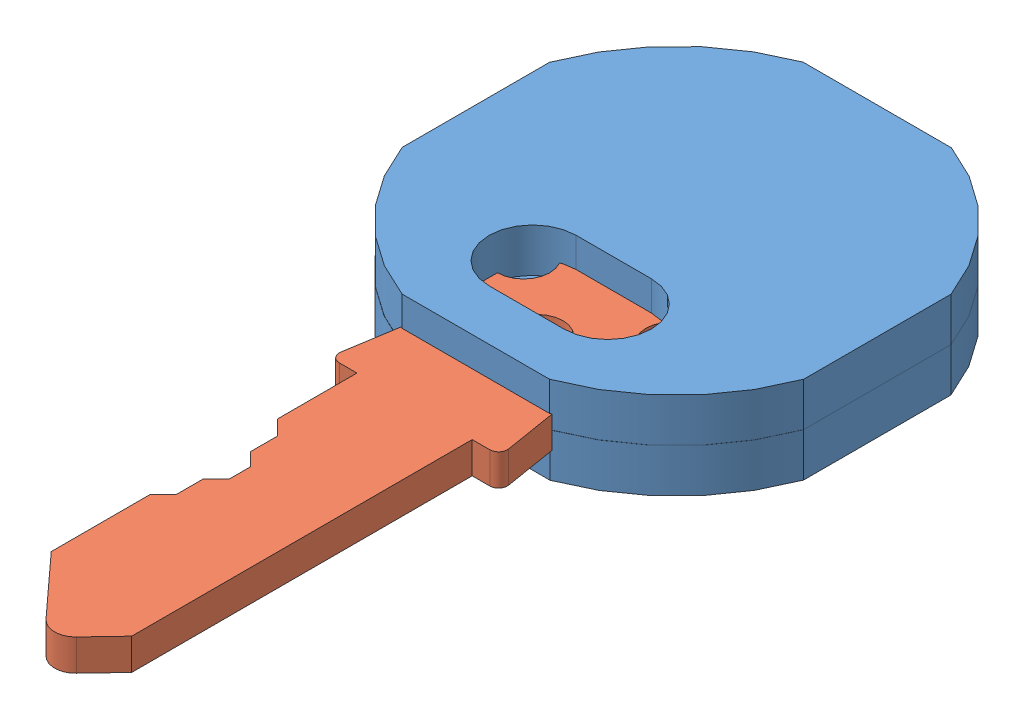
SolidWorks assembly 1108-U35_ASM.sldasm, configuration Default (file format 6000). Lengths in mm.
Overall size (23 5 48).
3 component instances, 2 part files, 3 mates.
Components (placement in the parent):
- 1108-15-01_PRT-1: 1108-15-01_PRT.sldprt [Default] at (0 0.9 -15) x (-1 0 0) z (0 0 1) size (23 2.5 22.99)
- 1108-15-01_PRT-2: 1108-15-01_PRT.sldprt [Default] at (0 1.1 -15.0109) x (-1 0 0) z (0 0 -1) size (23 2.5 22.99)
- 1108-14-333_PRT-1: 1108-14-333_PRT.sldprt [Default] at origin size (9.62 1.8 38)
Mates (geometry in assembly coordinates):
- Coincident1: coincident: plane of 1108-15-01_PRT-1 through (0 1 -10.0445) normal (0 1 0); plane of 1108-15-01_PRT-2 through (0.9289 1 -19.9664) normal (0 -1 0)
- Coincident2: coincident: plane of 1108-15-01_PRT-1 through (-4.2205 -1.5 -26.5) normal (0 0 -1); plane of 1108-15-01_PRT-2 through (4.25 3.5 -26.5) normal (0 0 -1)
- Coincident3: coincident aligned: plane of 1108-15-01_PRT-1 through (-11.5 -1.5 -10.7795) normal (-1 0 0); plane of 1108-15-01_PRT-2
